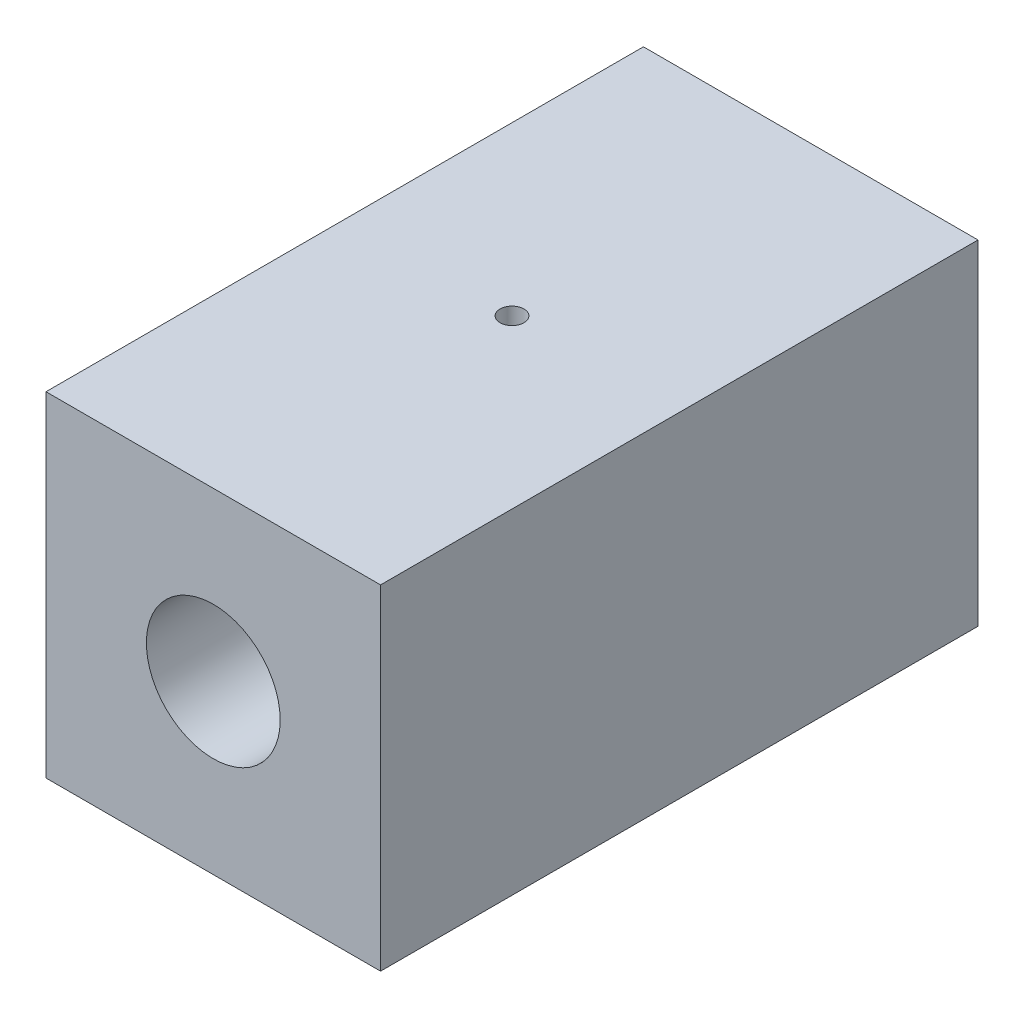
ISO-10303-21;
HEADER;
FILE_DESCRIPTION(('STEP AP214'),'2;1');
FILE_NAME('part.step','',(''),(''),'','','');
FILE_SCHEMA(('AUTOMOTIVE_DESIGN { 1 0 10303 214 1 1 1 1 }'));
ENDSEC;
DATA;
#1=APPLICATION_CONTEXT('core data for automotive mechanical design processes');
#2=APPLICATION_PROTOCOL_DEFINITION('international standard','automotive_design',2000,#1);
#3=PRODUCT_CONTEXT('',#1,'mechanical');
#4=PRODUCT('Part','Part','',(#3));
#5=PRODUCT_RELATED_PRODUCT_CATEGORY('part','',(#4));
#6=PRODUCT_DEFINITION_FORMATION('','',#4);
#7=PRODUCT_DEFINITION_CONTEXT('part definition',#1,'design');
#8=PRODUCT_DEFINITION('design','',#6,#7);
#9=PRODUCT_DEFINITION_SHAPE('','',#8);
#10=(LENGTH_UNIT() NAMED_UNIT(*) SI_UNIT(.MILLI.,.METRE.));
#11=(NAMED_UNIT(*) PLANE_ANGLE_UNIT() SI_UNIT($,.RADIAN.));
#12=(NAMED_UNIT(*) SI_UNIT($,.STERADIAN.) SOLID_ANGLE_UNIT());
#13=UNCERTAINTY_MEASURE_WITH_UNIT(LENGTH_MEASURE(1.E-05),#10,'distance_accuracy_value','');
#14=(GEOMETRIC_REPRESENTATION_CONTEXT(3) GLOBAL_UNCERTAINTY_ASSIGNED_CONTEXT((#13)) GLOBAL_UNIT_ASSIGNED_CONTEXT((#10,
#11,#12)) REPRESENTATION_CONTEXT('',''));
#15=CARTESIAN_POINT('',(0.,0.,0.));
#16=DIRECTION('',(0.,0.,1.));
#17=DIRECTION('',(1.,0.,0.));
#18=AXIS2_PLACEMENT_3D('',#15,#16,#17);
#19=CARTESIAN_POINT('',(0.,-70.,125.));
#20=DIRECTION('',(0.,0.,1.));
#21=DIRECTION('',(1.,0.,0.));
#22=AXIS2_PLACEMENT_3D('',#19,#20,#21);
#23=PLANE('',#22);
#24=DIRECTION('',(0.,-1.,0.));
#25=VECTOR('',#24,1.);
#26=CARTESIAN_POINT('',(0.,0.,125.));
#27=LINE('',#26,#25);
#28=CARTESIAN_POINT('',(0.,0.,125.));
#29=VERTEX_POINT('',#28);
#30=CARTESIAN_POINT('',(0.,-70.,125.));
#31=VERTEX_POINT('',#30);
#32=EDGE_CURVE('E103',#29,#31,#27,.T.);
#33=ORIENTED_EDGE('',*,*,#32,.T.);
#34=DIRECTION('',(1.,0.,0.));
#35=VECTOR('',#34,1.);
#36=CARTESIAN_POINT('',(0.,-70.,125.));
#37=LINE('',#36,#35);
#38=CARTESIAN_POINT('',(70.,-70.,125.));
#39=VERTEX_POINT('',#38);
#40=EDGE_CURVE('E88',#31,#39,#37,.T.);
#41=ORIENTED_EDGE('',*,*,#40,.T.);
#42=DIRECTION('',(0.,1.,0.));
#43=VECTOR('',#42,1.);
#44=CARTESIAN_POINT('',(70.,0.,125.));
#45=LINE('',#44,#43);
#46=CARTESIAN_POINT('',(70.,0.,125.));
#47=VERTEX_POINT('',#46);
#48=EDGE_CURVE('E54',#39,#47,#45,.T.);
#49=ORIENTED_EDGE('',*,*,#48,.T.);
#50=DIRECTION('',(-1.,0.,0.));
#51=VECTOR('',#50,1.);
#52=CARTESIAN_POINT('',(0.,0.,125.));
#53=LINE('',#52,#51);
#54=EDGE_CURVE('E49',#47,#29,#53,.T.);
#55=ORIENTED_EDGE('',*,*,#54,.T.);
#56=EDGE_LOOP('',(#33,#41,#49,#55));
#57=FACE_BOUND('',#56,.T.);
#58=CARTESIAN_POINT('',(35.,-35.,125.));
#59=DIRECTION('',(0.,0.,1.));
#60=DIRECTION('',(1.,0.,0.));
#61=AXIS2_PLACEMENT_3D('',#58,#59,#60);
#62=CIRCLE('',#61,14.);
#63=CARTESIAN_POINT('',(49.,-35.,125.));
#64=VERTEX_POINT('',#63);
#65=EDGE_CURVE('E93',#64,#64,#62,.T.);
#66=ORIENTED_EDGE('',*,*,#65,.F.);
#67=EDGE_LOOP('',(#66));
#68=FACE_BOUND('',#67,.T.);
#69=ADVANCED_FACE('F29',(#57,#68),#23,.T.);
#70=CARTESIAN_POINT('',(0.,-70.,0.));
#71=DIRECTION('',(0.,0.,1.));
#72=DIRECTION('',(1.,0.,0.));
#73=AXIS2_PLACEMENT_3D('',#70,#71,#72);
#74=PLANE('',#73);
#75=DIRECTION('',(0.,-1.,0.));
#76=VECTOR('',#75,1.);
#77=CARTESIAN_POINT('',(0.,0.,0.));
#78=LINE('',#77,#76);
#79=CARTESIAN_POINT('',(0.,0.,0.));
#80=VERTEX_POINT('',#79);
#81=CARTESIAN_POINT('',(0.,-70.,0.));
#82=VERTEX_POINT('',#81);
#83=EDGE_CURVE('E80',#80,#82,#78,.T.);
#84=ORIENTED_EDGE('',*,*,#83,.F.);
#85=DIRECTION('',(-1.,0.,0.));
#86=VECTOR('',#85,1.);
#87=CARTESIAN_POINT('',(0.,0.,0.));
#88=LINE('',#87,#86);
#89=CARTESIAN_POINT('',(70.,0.,0.));
#90=VERTEX_POINT('',#89);
#91=EDGE_CURVE('E101',#90,#80,#88,.T.);
#92=ORIENTED_EDGE('',*,*,#91,.F.);
#93=DIRECTION('',(0.,1.,0.));
#94=VECTOR('',#93,1.);
#95=CARTESIAN_POINT('',(70.,0.,0.));
#96=LINE('',#95,#94);
#97=CARTESIAN_POINT('',(70.,-70.,0.));
#98=VERTEX_POINT('',#97);
#99=EDGE_CURVE('E81',#98,#90,#96,.T.);
#100=ORIENTED_EDGE('',*,*,#99,.F.);
#101=DIRECTION('',(1.,0.,0.));
#102=VECTOR('',#101,1.);
#103=CARTESIAN_POINT('',(0.,-70.,0.));
#104=LINE('',#103,#102);
#105=EDGE_CURVE('E75',#82,#98,#104,.T.);
#106=ORIENTED_EDGE('',*,*,#105,.F.);
#107=EDGE_LOOP('',(#84,#92,#100,#106));
#108=FACE_BOUND('',#107,.T.);
#109=CARTESIAN_POINT('',(35.,-35.,0.));
#110=DIRECTION('',(0.,0.,1.));
#111=DIRECTION('',(1.,0.,0.));
#112=AXIS2_PLACEMENT_3D('',#109,#110,#111);
#113=CIRCLE('',#112,14.);
#114=CARTESIAN_POINT('',(49.,-35.,0.));
#115=VERTEX_POINT('',#114);
#116=EDGE_CURVE('E96',#115,#115,#113,.T.);
#117=ORIENTED_EDGE('',*,*,#116,.T.);
#118=EDGE_LOOP('',(#117));
#119=FACE_BOUND('',#118,.T.);
#120=ADVANCED_FACE('F76',(#108,#119),#74,.F.);
#121=CARTESIAN_POINT('',(0.,0.,125.));
#122=DIRECTION('',(1.,0.,0.));
#123=DIRECTION('',(0.,1.,0.));
#124=AXIS2_PLACEMENT_3D('',#121,#122,#123);
#125=PLANE('',#124);
#126=ORIENTED_EDGE('',*,*,#83,.T.);
#127=DIRECTION('',(0.,0.,-1.));
#128=VECTOR('',#127,1.);
#129=CARTESIAN_POINT('',(0.,-70.,125.));
#130=LINE('',#129,#128);
#131=EDGE_CURVE('E11',#31,#82,#130,.T.);
#132=ORIENTED_EDGE('',*,*,#131,.F.);
#133=ORIENTED_EDGE('',*,*,#32,.F.);
#134=DIRECTION('',(0.,0.,-1.));
#135=VECTOR('',#134,1.);
#136=CARTESIAN_POINT('',(0.,0.,125.));
#137=LINE('',#136,#135);
#138=EDGE_CURVE('E92',#29,#80,#137,.T.);
#139=ORIENTED_EDGE('',*,*,#138,.T.);
#140=EDGE_LOOP('',(#126,#132,#133,#139));
#141=FACE_BOUND('',#140,.T.);
#142=ADVANCED_FACE('F31',(#141),#125,.F.);
#143=CARTESIAN_POINT('',(0.,-70.,125.));
#144=DIRECTION('',(0.,1.,0.));
#145=DIRECTION('',(0.,0.,1.));
#146=AXIS2_PLACEMENT_3D('',#143,#144,#145);
#147=PLANE('',#146);
#148=ORIENTED_EDGE('',*,*,#105,.T.);
#149=DIRECTION('',(0.,0.,-1.));
#150=VECTOR('',#149,1.);
#151=CARTESIAN_POINT('',(70.,-70.,125.));
#152=LINE('',#151,#150);
#153=EDGE_CURVE('E42',#39,#98,#152,.T.);
#154=ORIENTED_EDGE('',*,*,#153,.F.);
#155=ORIENTED_EDGE('',*,*,#40,.F.);
#156=ORIENTED_EDGE('',*,*,#131,.T.);
#157=EDGE_LOOP('',(#148,#154,#155,#156));
#158=FACE_BOUND('',#157,.T.);
#159=ADVANCED_FACE('F87',(#158),#147,.F.);
#160=CARTESIAN_POINT('',(70.,0.,125.));
#161=DIRECTION('',(-1.,0.,0.));
#162=DIRECTION('',(0.,0.,1.));
#163=AXIS2_PLACEMENT_3D('',#160,#161,#162);
#164=PLANE('',#163);
#165=ORIENTED_EDGE('',*,*,#99,.T.);
#166=DIRECTION('',(0.,0.,-1.));
#167=VECTOR('',#166,1.);
#168=CARTESIAN_POINT('',(70.,0.,125.));
#169=LINE('',#168,#167);
#170=EDGE_CURVE('E109',#47,#90,#169,.T.);
#171=ORIENTED_EDGE('',*,*,#170,.F.);
#172=ORIENTED_EDGE('',*,*,#48,.F.);
#173=ORIENTED_EDGE('',*,*,#153,.T.);
#174=EDGE_LOOP('',(#165,#171,#172,#173));
#175=FACE_BOUND('',#174,.T.);
#176=ADVANCED_FACE('F113',(#175),#164,.F.);
#177=CARTESIAN_POINT('',(0.,0.,125.));
#178=DIRECTION('',(0.,-1.,0.));
#179=DIRECTION('',(0.,0.,-1.));
#180=AXIS2_PLACEMENT_3D('',#177,#178,#179);
#181=PLANE('',#180);
#182=CARTESIAN_POINT('',(35.,0.,62.5));
#183=DIRECTION('',(0.,1.,0.));
#184=DIRECTION('',(0.,0.,1.));
#185=AXIS2_PLACEMENT_3D('',#182,#183,#184);
#186=CIRCLE('',#185,2.5);
#187=CARTESIAN_POINT('',(35.,0.,65.));
#188=VERTEX_POINT('',#187);
#189=EDGE_CURVE('E129',#188,#188,#186,.T.);
#190=ORIENTED_EDGE('',*,*,#189,.F.);
#191=EDGE_LOOP('',(#190));
#192=FACE_BOUND('',#191,.T.);
#193=ORIENTED_EDGE('',*,*,#91,.T.);
#194=ORIENTED_EDGE('',*,*,#138,.F.);
#195=ORIENTED_EDGE('',*,*,#54,.F.);
#196=ORIENTED_EDGE('',*,*,#170,.T.);
#197=EDGE_LOOP('',(#193,#194,#195,#196));
#198=FACE_BOUND('',#197,.T.);
#199=ADVANCED_FACE('F115',(#192,#198),#181,.F.);
#200=CARTESIAN_POINT('',(35.,-35.,125.));
#201=DIRECTION('',(0.,0.,-1.));
#202=DIRECTION('',(-1.,0.,0.));
#203=AXIS2_PLACEMENT_3D('',#200,#201,#202);
#204=CYLINDRICAL_SURFACE('',#203,14.);
#205=CARTESIAN_POINT('',(35.,-21.,65.));
#206=CARTESIAN_POINT('',(34.8607604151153,-21.0000024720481,64.9999945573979));
#207=CARTESIAN_POINT('',(34.7214486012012,-21.0020987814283,64.9883280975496));
#208=CARTESIAN_POINT('',(34.4467425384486,-21.0102594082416,64.9419958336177));
#209=CARTESIAN_POINT('',(34.3113518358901,-21.0163272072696,64.9073098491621));
#210=CARTESIAN_POINT('',(34.0485012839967,-21.0317512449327,64.816027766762));
#211=CARTESIAN_POINT('',(33.9210346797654,-21.0411046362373,64.7594506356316));
#212=CARTESIAN_POINT('',(33.6774170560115,-21.0620753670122,64.6260443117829));
#213=CARTESIAN_POINT('',(33.5612649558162,-21.0736924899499,64.5492170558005));
#214=CARTESIAN_POINT('',(33.3422925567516,-21.0980476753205,64.3766007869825));
#215=CARTESIAN_POINT('',(33.239613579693,-21.1107955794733,64.2806338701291));
#216=CARTESIAN_POINT('',(33.0517238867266,-21.1359015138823,64.0728452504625));
#217=CARTESIAN_POINT('',(32.966514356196,-21.148259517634,63.9610224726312));
#218=CARTESIAN_POINT('',(32.8154039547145,-21.171281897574,63.7237098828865));
#219=CARTESIAN_POINT('',(32.7496450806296,-21.1819335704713,63.598128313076));
#220=CARTESIAN_POINT('',(32.6402112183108,-21.200199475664,63.3374788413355));
#221=CARTESIAN_POINT('',(32.5965345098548,-21.2078139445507,63.2024116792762));
#222=CARTESIAN_POINT('',(32.5329547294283,-21.2190446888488,62.9281311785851));
#223=CARTESIAN_POINT('',(32.5128062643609,-21.2227022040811,62.7889764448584));
#224=CARTESIAN_POINT('',(32.4960935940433,-21.2257294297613,62.5092170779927));
#225=CARTESIAN_POINT('',(32.4995274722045,-21.2250994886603,62.3686125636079));
#226=CARTESIAN_POINT('',(32.5296826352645,-21.21966057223,62.0917111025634));
#227=CARTESIAN_POINT('',(32.5561263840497,-21.2149014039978,61.9553828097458));
#228=CARTESIAN_POINT('',(32.6311142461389,-21.2018183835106,61.6891293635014));
#229=CARTESIAN_POINT('',(32.6796592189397,-21.1934943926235,61.5592044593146));
#230=CARTESIAN_POINT('',(32.7977473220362,-21.1741667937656,61.3086255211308));
#231=CARTESIAN_POINT('',(32.8674039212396,-21.163148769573,61.1880261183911));
#232=CARTESIAN_POINT('',(33.025657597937,-21.1396842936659,60.9601224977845));
#233=CARTESIAN_POINT('',(33.1142564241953,-21.1272377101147,60.8528195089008));
#234=CARTESIAN_POINT('',(33.3093829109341,-21.1021006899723,60.6529497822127));
#235=CARTESIAN_POINT('',(33.4161482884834,-21.0894093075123,60.5606150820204));
#236=CARTESIAN_POINT('',(33.6437779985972,-21.065376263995,60.395133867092));
#237=CARTESIAN_POINT('',(33.7646424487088,-21.0540346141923,60.3219875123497));
#238=CARTESIAN_POINT('',(34.0172708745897,-21.0339591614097,60.1969309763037));
#239=CARTESIAN_POINT('',(34.1490462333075,-21.0252281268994,60.1450433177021));
#240=CARTESIAN_POINT('',(34.4196325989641,-21.0113793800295,60.064203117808));
#241=CARTESIAN_POINT('',(34.5584429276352,-21.0062613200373,60.0352483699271));
#242=CARTESIAN_POINT('',(34.8371610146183,-21.000262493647,60.001415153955));
#243=CARTESIAN_POINT('',(34.9770289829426,-20.9993257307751,59.996218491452));
#244=CARTESIAN_POINT('',(35.255635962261,-21.0016409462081,60.0091977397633));
#245=CARTESIAN_POINT('',(35.3943750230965,-21.0048927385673,60.0273726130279));
#246=CARTESIAN_POINT('',(35.66578830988,-21.0151849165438,60.0863143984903));
#247=CARTESIAN_POINT('',(35.7984982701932,-21.0221985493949,60.1269218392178));
#248=CARTESIAN_POINT('',(36.0552266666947,-21.039231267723,60.2294046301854));
#249=CARTESIAN_POINT('',(36.1792445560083,-21.0492505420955,60.2912813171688));
#250=CARTESIAN_POINT('',(36.4164370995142,-21.0713226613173,60.4352612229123));
#251=CARTESIAN_POINT('',(36.5294907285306,-21.0833948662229,60.5175607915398));
#252=CARTESIAN_POINT('',(36.7402966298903,-21.1081803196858,60.6997826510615));
#253=CARTESIAN_POINT('',(36.8380476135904,-21.1208936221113,60.7997064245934));
#254=CARTESIAN_POINT('',(37.0166694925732,-21.1457121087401,61.0157749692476));
#255=CARTESIAN_POINT('',(37.0973241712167,-21.1578081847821,61.1320997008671));
#256=CARTESIAN_POINT('',(37.237948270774,-21.1798453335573,61.3768336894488));
#257=CARTESIAN_POINT('',(37.2979184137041,-21.1897864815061,61.5052425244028));
#258=CARTESIAN_POINT('',(37.3951570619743,-21.2063180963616,61.7699261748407));
#259=CARTESIAN_POINT('',(37.4325284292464,-21.2129237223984,61.9061622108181));
#260=CARTESIAN_POINT('',(37.4838289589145,-21.2220725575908,62.1831072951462));
#261=CARTESIAN_POINT('',(37.4977604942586,-21.2246161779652,62.3238158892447));
#262=CARTESIAN_POINT('',(37.5017122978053,-21.2253335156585,62.6035492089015));
#263=CARTESIAN_POINT('',(37.4920732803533,-21.2235695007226,62.7425690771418));
#264=CARTESIAN_POINT('',(37.449899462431,-21.2160076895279,63.0169738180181));
#265=CARTESIAN_POINT('',(37.4173647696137,-21.2102099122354,63.1523587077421));
#266=CARTESIAN_POINT('',(37.3304611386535,-21.1952589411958,63.4154898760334));
#267=CARTESIAN_POINT('',(37.2761257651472,-21.1861109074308,63.5432475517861));
#268=CARTESIAN_POINT('',(37.1471993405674,-21.1654859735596,63.7878884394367));
#269=CARTESIAN_POINT('',(37.0726070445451,-21.1540089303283,63.9047709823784));
#270=CARTESIAN_POINT('',(36.9040856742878,-21.1298240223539,64.12605704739));
#271=CARTESIAN_POINT('',(36.809907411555,-21.117101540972,64.2302692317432));
#272=CARTESIAN_POINT('',(36.6054099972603,-21.0919717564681,64.4215258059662));
#273=CARTESIAN_POINT('',(36.4950871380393,-21.079564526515,64.5085662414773));
#274=CARTESIAN_POINT('',(36.2603707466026,-21.0563465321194,64.6636577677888));
#275=CARTESIAN_POINT('',(36.1358710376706,-21.0455494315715,64.7315502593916));
#276=CARTESIAN_POINT('',(35.8770848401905,-21.0269012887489,64.8453492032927));
#277=CARTESIAN_POINT('',(35.7428079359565,-21.0190474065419,64.8912768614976));
#278=CARTESIAN_POINT('',(35.5067317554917,-21.0088220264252,64.9502306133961));
#279=CARTESIAN_POINT('',(35.4063348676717,-21.0055320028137,64.9688631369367));
#280=CARTESIAN_POINT('',(35.2039715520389,-21.0011201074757,64.9937496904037));
#281=CARTESIAN_POINT('',(35.1020051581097,-20.9999981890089,65.0000039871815));
#282=CARTESIAN_POINT('',(35.,-21.,65.));
#283=B_SPLINE_CURVE_WITH_KNOTS('',3,(#205,#206,#207,#208,#209,#210,#211,#212,#213,#214,#215,
#216,#217,#218,#219,#220,#221,#222,#223,#224,#225,#226,#227,#228,#229,#230,#231,#232,#233,#234,
#235,#236,#237,#238,#239,#240,#241,#242,#243,#244,#245,#246,#247,#248,#249,#250,#251,#252,#253,
#254,#255,#256,#257,#258,#259,#260,#261,#262,#263,#264,#265,#266,#267,#268,#269,#270,#271,#272,
#273,#274,#275,#276,#277,#278,#279,#280,#281,#282),.UNSPECIFIED.,.T.,.F.,(4,2,2,2,2,2,2,2,2,2,2,
2,2,2,2,2,2,2,2,2,2,2,2,2,2,2,2,2,2,2,2,2,2,2,2,2,2,2,4),(0.,0.41734579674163,0.835057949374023,
1.25240899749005,1.66972014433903,2.09110796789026,2.51252437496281,2.93694536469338,
3.36133328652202,3.78125426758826,4.20114112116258,4.61603258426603,5.03094018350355,
5.44811857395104,5.86533549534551,6.28850377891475,6.71167559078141,7.13529458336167,
7.55887281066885,7.97676106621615,8.39463077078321,8.80956740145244,9.22453011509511,
9.64364840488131,10.062801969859,10.4869762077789,10.9111356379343,11.3333496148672,
11.7555208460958,12.1716257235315,12.5877286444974,13.0031933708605,13.4186836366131,
13.8398246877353,14.2610626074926,14.6856934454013,15.109913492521,15.4156623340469,
15.7214045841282),.UNSPECIFIED.);
#284=CARTESIAN_POINT('',(35.,-21.,65.));
#285=VERTEX_POINT('',#284);
#286=EDGE_CURVE('E33',#285,#285,#283,.T.);
#287=ORIENTED_EDGE('',*,*,#286,.F.);
#288=EDGE_LOOP('',(#287));
#289=FACE_BOUND('',#288,.T.);
#290=ORIENTED_EDGE('',*,*,#65,.T.);
#291=EDGE_LOOP('',(#290));
#292=FACE_BOUND('',#291,.T.);
#293=ORIENTED_EDGE('',*,*,#116,.F.);
#294=EDGE_LOOP('',(#293));
#295=FACE_BOUND('',#294,.T.);
#296=ADVANCED_FACE('F121',(#289,#292,#295),#204,.F.);
#297=CARTESIAN_POINT('',(35.,-35.,62.5));
#298=DIRECTION('',(0.,1.,0.));
#299=DIRECTION('',(0.,0.,1.));
#300=AXIS2_PLACEMENT_3D('',#297,#298,#299);
#301=CYLINDRICAL_SURFACE('',#300,2.5);
#302=ORIENTED_EDGE('',*,*,#286,.T.);
#303=EDGE_LOOP('',(#302));
#304=FACE_BOUND('',#303,.T.);
#305=ORIENTED_EDGE('',*,*,#189,.T.);
#306=EDGE_LOOP('',(#305));
#307=FACE_BOUND('',#306,.T.);
#308=ADVANCED_FACE('F124',(#304,#307),#301,.F.);
#309=CLOSED_SHELL('',(#69,#120,#142,#159,#176,#199,#296,#308));
#310=MANIFOLD_SOLID_BREP('B2',#309);
#311=ADVANCED_BREP_SHAPE_REPRESENTATION('',(#18,#310),#14);
#312=SHAPE_DEFINITION_REPRESENTATION(#9,#311);
ENDSEC;
END-ISO-10303-21;
